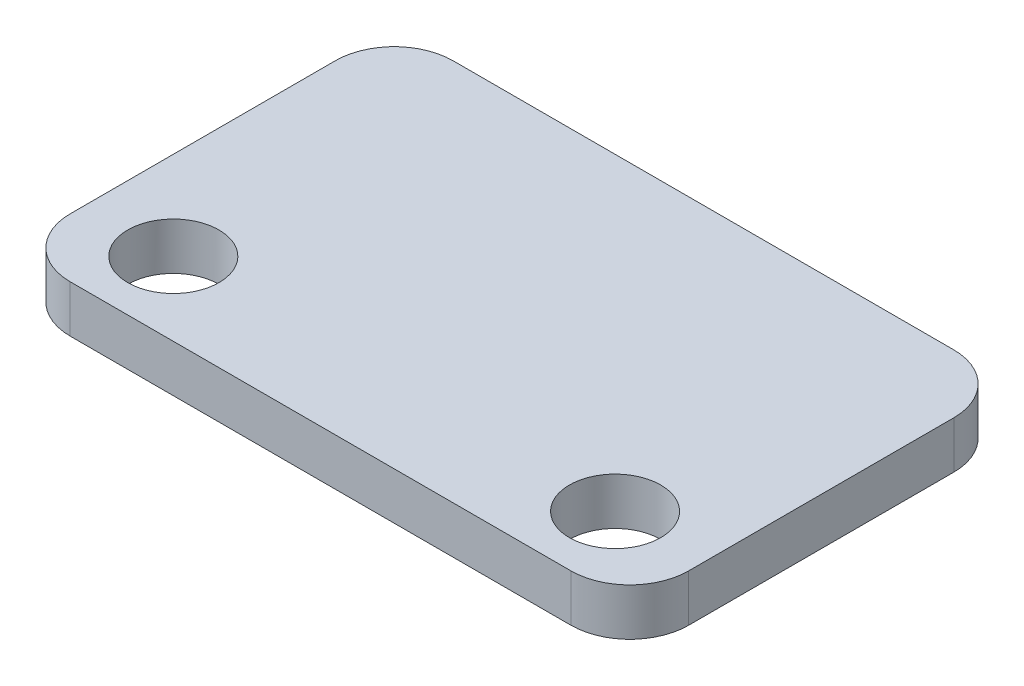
from build123d import *

# Parameters (mm, degrees)
EXTRUDE_1_DEPTH     = 1.6
CUT_EXTRUDE_1_REACH = 14.452
SKETCH_2_R          = 1.55


with BuildPart() as part:
    # Sketch 1 → Extrude 1 (new body)
    with BuildSketch(Plane(origin=(0, 0, 0), x_dir=(1, 0, 0), z_dir=(0, 1, 0))):
        with BuildLine():
            Line((-8.5, 6.5), (8.5, 6.5))
            ThreePointArc((8.5, 6.5), (9.914213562, 5.914213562), (10.5, 4.5))
            Line((10.5, 4.5), (10.5, -4.5))
            ThreePointArc((10.5, -4.5), (9.914213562, -5.914213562), (8.5, -6.5))
            Line((8.5, -6.5), (-8.5, -6.5))
            ThreePointArc((-8.5, -6.5), (-9.914213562, -5.914213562), (-10.5, -4.5))
            Line((-10.5, -4.5), (-10.5, 4.5))
            ThreePointArc((-10.5, 4.5), (-9.914213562, 5.914213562), (-8.5, 6.5))
        make_face()
    extrude(amount=EXTRUDE_1_DEPTH)

    # Sketch 2 → Cut-Extrude 1 (cut, up to next)
    with BuildSketch(Plane(origin=(0, 1.6, 0), x_dir=(1, 0, 0), z_dir=(0, 1, 0)), mode=Mode.PRIVATE) as cut_extrude_1_sk1:
        with Locations(Location((-7.5, -4, 0), (0, 0, 270))):
            Circle(SKETCH_2_R)
    cut_extrude_1_tool1 = extrude(cut_extrude_1_sk1.sketch, amount=-CUT_EXTRUDE_1_REACH, mode=Mode.PRIVATE) & part.part
    # Sketch 2 → Cut-Extrude 1 (cut, up to next)
    with BuildSketch(Plane(origin=(0, 1.6, 0), x_dir=(1, 0, 0), z_dir=(0, 1, 0)), mode=Mode.PRIVATE) as cut_extrude_1_sk2:
        with Locations(Location((7.5, -4, 0), (0, 0, 90))):
            Circle(SKETCH_2_R)
    cut_extrude_1_tool2 = extrude(cut_extrude_1_sk2.sketch, amount=-CUT_EXTRUDE_1_REACH, mode=Mode.PRIVATE) & part.part
    add(cut_extrude_1_tool1.solids().sort_by_distance((-7.5, 1.6, 4))[0], mode=Mode.SUBTRACT)
    add(cut_extrude_1_tool2.solids().sort_by_distance((7.5, 1.6, 4))[0], mode=Mode.SUBTRACT)


solid = part.part
